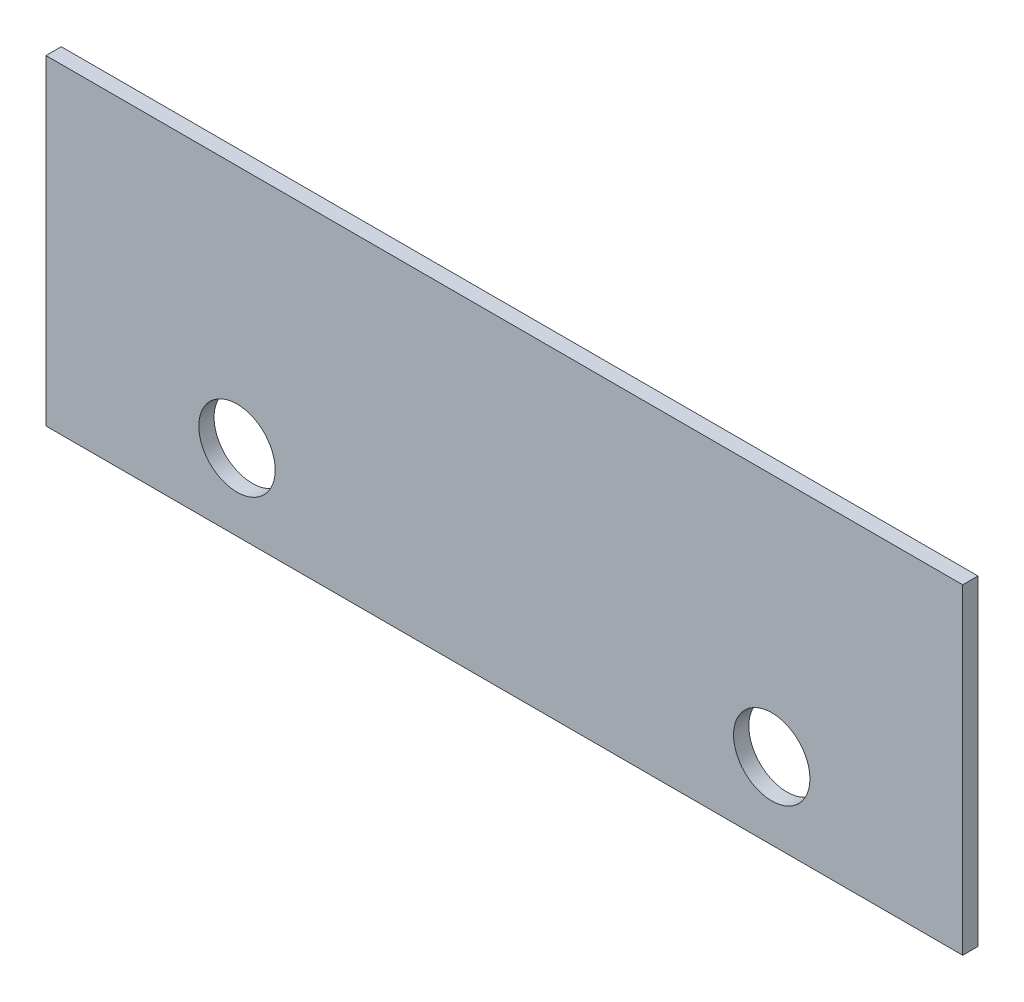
from build123d import *

# Parameters (mm, degrees)
ESQUISSE1_W          = 60
ESQUISSE1_H          = 21
ESQUISSE1_R          = 2.5
BASE_EXTRUSION_DEPTH = 1


with BuildPart() as part:
    # Esquisse1 → Base-Extrusion (new body)
    with BuildSketch(Plane.XY):
        Rectangle(ESQUISSE1_W, ESQUISSE1_H)
        with Locations((-17.5, -5.5)):
            Circle(ESQUISSE1_R, mode=Mode.SUBTRACT)
        with Locations((17.5, -5.5)):
            Circle(ESQUISSE1_R, mode=Mode.SUBTRACT)
    extrude(amount=-BASE_EXTRUSION_DEPTH)


solid = part.part
